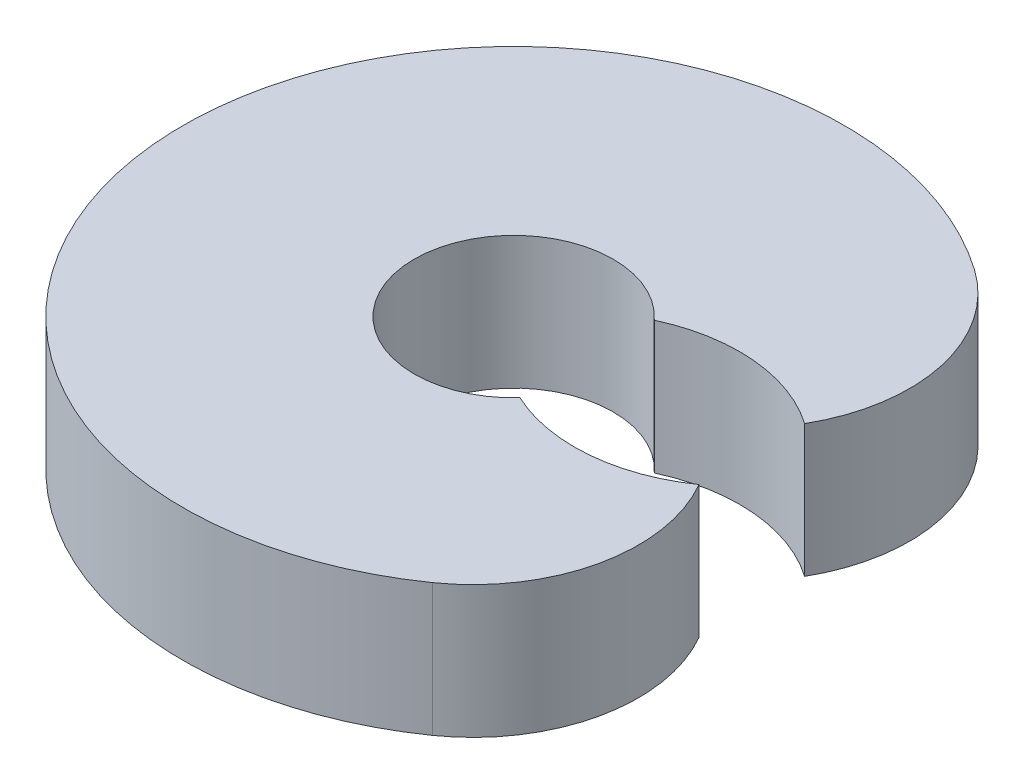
ISO-10303-21;
HEADER;
FILE_DESCRIPTION(('STEP AP214'),'2;1');
FILE_NAME('part.step','',(''),(''),'','','');
FILE_SCHEMA(('AUTOMOTIVE_DESIGN { 1 0 10303 214 1 1 1 1 }'));
ENDSEC;
DATA;
#1=APPLICATION_CONTEXT('core data for automotive mechanical design processes');
#2=APPLICATION_PROTOCOL_DEFINITION('international standard','automotive_design',2000,#1);
#3=PRODUCT_CONTEXT('',#1,'mechanical');
#4=PRODUCT('Part','Part','',(#3));
#5=PRODUCT_RELATED_PRODUCT_CATEGORY('part','',(#4));
#6=PRODUCT_DEFINITION_FORMATION('','',#4);
#7=PRODUCT_DEFINITION_CONTEXT('part definition',#1,'design');
#8=PRODUCT_DEFINITION('design','',#6,#7);
#9=PRODUCT_DEFINITION_SHAPE('','',#8);
#10=(LENGTH_UNIT() NAMED_UNIT(*) SI_UNIT(.MILLI.,.METRE.));
#11=(NAMED_UNIT(*) PLANE_ANGLE_UNIT() SI_UNIT($,.RADIAN.));
#12=(NAMED_UNIT(*) SI_UNIT($,.STERADIAN.) SOLID_ANGLE_UNIT());
#13=UNCERTAINTY_MEASURE_WITH_UNIT(LENGTH_MEASURE(1.E-05),#10,'distance_accuracy_value','');
#14=(GEOMETRIC_REPRESENTATION_CONTEXT(3) GLOBAL_UNCERTAINTY_ASSIGNED_CONTEXT((#13)) GLOBAL_UNIT_ASSIGNED_CONTEXT((#10,
#11,#12)) REPRESENTATION_CONTEXT('',''));
#15=CARTESIAN_POINT('',(0.,0.,0.));
#16=DIRECTION('',(0.,0.,1.));
#17=DIRECTION('',(1.,0.,0.));
#18=AXIS2_PLACEMENT_3D('',#15,#16,#17);
#19=CARTESIAN_POINT('',(216.627566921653,205.,125.084822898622));
#20=DIRECTION('',(0.,-1.,0.));
#21=DIRECTION('',(0.,0.,-1.));
#22=AXIS2_PLACEMENT_3D('',#19,#20,#21);
#23=CYLINDRICAL_SURFACE('',#22,250.);
#24=CARTESIAN_POINT('',(216.627566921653,5.,125.084822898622));
#25=DIRECTION('',(0.,-1.,0.));
#26=DIRECTION('',(0.,0.,-1.));
#27=AXIS2_PLACEMENT_3D('',#24,#25,#26);
#28=CIRCLE('',#27,250.);
#29=CARTESIAN_POINT('',(110.987220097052,5.,-101.498753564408));
#30=VERTEX_POINT('',#29);
#31=CARTESIAN_POINT('',(359.900460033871,5.,-79.7880110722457));
#32=VERTEX_POINT('',#31);
#33=EDGE_CURVE('E122',#30,#32,#28,.T.);
#34=ORIENTED_EDGE('',*,*,#33,.T.);
#35=DIRECTION('',(0.,-1.,0.));
#36=VECTOR('',#35,1.);
#37=CARTESIAN_POINT('',(359.900460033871,205.,-79.7880110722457));
#38=LINE('',#37,#36);
#39=CARTESIAN_POINT('',(359.900460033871,205.,-79.7880110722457));
#40=VERTEX_POINT('',#39);
#41=EDGE_CURVE('E11',#40,#32,#38,.T.);
#42=ORIENTED_EDGE('',*,*,#41,.F.);
#43=CARTESIAN_POINT('',(216.627566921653,205.,125.084822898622));
#44=DIRECTION('',(0.,-1.,0.));
#45=DIRECTION('',(0.,0.,-1.));
#46=AXIS2_PLACEMENT_3D('',#43,#44,#45);
#47=CIRCLE('',#46,250.);
#48=CARTESIAN_POINT('',(110.987220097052,205.,-101.498753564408));
#49=VERTEX_POINT('',#48);
#50=EDGE_CURVE('E132',#49,#40,#47,.T.);
#51=ORIENTED_EDGE('',*,*,#50,.F.);
#52=DIRECTION('',(0.,-1.,0.));
#53=VECTOR('',#52,1.);
#54=CARTESIAN_POINT('',(110.987220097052,205.,-101.498753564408));
#55=LINE('',#54,#53);
#56=EDGE_CURVE('E118',#49,#30,#55,.T.);
#57=ORIENTED_EDGE('',*,*,#56,.T.);
#58=EDGE_LOOP('',(#34,#42,#51,#57));
#59=FACE_BOUND('',#58,.T.);
#60=ADVANCED_FACE('F38',(#59),#23,.F.);
#61=CARTESIAN_POINT('',(143.394109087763,205.,-204.788011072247));
#62=DIRECTION('',(0.,-1.,0.));
#63=DIRECTION('',(0.,0.,-1.));
#64=AXIS2_PLACEMENT_3D('',#61,#62,#63);
#65=CYLINDRICAL_SURFACE('',#64,250.);
#66=CARTESIAN_POINT('',(143.394109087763,5.,-204.788011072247));
#67=DIRECTION('',(0.,1.,0.));
#68=DIRECTION('',(0.,0.,1.));
#69=AXIS2_PLACEMENT_3D('',#66,#67,#68);
#70=CIRCLE('',#69,250.);
#71=CARTESIAN_POINT('',(286.788218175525,5.,-409.576022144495));
#72=VERTEX_POINT('',#71);
#73=EDGE_CURVE('E125',#32,#72,#70,.T.);
#74=ORIENTED_EDGE('',*,*,#73,.T.);
#75=DIRECTION('',(0.,-1.,0.));
#76=VECTOR('',#75,1.);
#77=CARTESIAN_POINT('',(286.788218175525,205.,-409.576022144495));
#78=LINE('',#77,#76);
#79=CARTESIAN_POINT('',(286.788218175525,205.,-409.576022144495));
#80=VERTEX_POINT('',#79);
#81=EDGE_CURVE('E46',#80,#72,#78,.T.);
#82=ORIENTED_EDGE('',*,*,#81,.F.);
#83=CARTESIAN_POINT('',(143.394109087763,205.,-204.788011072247));
#84=DIRECTION('',(0.,1.,0.));
#85=DIRECTION('',(0.,0.,1.));
#86=AXIS2_PLACEMENT_3D('',#83,#84,#85);
#87=CIRCLE('',#86,250.);
#88=EDGE_CURVE('E91',#40,#80,#87,.T.);
#89=ORIENTED_EDGE('',*,*,#88,.F.);
#90=ORIENTED_EDGE('',*,*,#41,.T.);
#91=EDGE_LOOP('',(#74,#82,#89,#90));
#92=FACE_BOUND('',#91,.T.);
#93=ADVANCED_FACE('F156',(#92),#65,.T.);
#94=CARTESIAN_POINT('',(0.,205.,0.));
#95=DIRECTION('',(0.,-1.,0.));
#96=DIRECTION('',(0.,0.,-1.));
#97=AXIS2_PLACEMENT_3D('',#94,#95,#96);
#98=CYLINDRICAL_SURFACE('',#97,500.);
#99=CARTESIAN_POINT('',(0.,5.,0.));
#100=DIRECTION('',(0.,1.,0.));
#101=DIRECTION('',(0.,0.,1.));
#102=AXIS2_PLACEMENT_3D('',#99,#100,#101);
#103=CIRCLE('',#102,500.);
#104=CARTESIAN_POINT('',(286.788218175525,5.,409.576022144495));
#105=VERTEX_POINT('',#104);
#106=EDGE_CURVE('E127',#72,#105,#103,.T.);
#107=ORIENTED_EDGE('',*,*,#106,.T.);
#108=DIRECTION('',(0.,-1.,0.));
#109=VECTOR('',#108,1.);
#110=CARTESIAN_POINT('',(286.788218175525,205.,409.576022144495));
#111=LINE('',#110,#109);
#112=CARTESIAN_POINT('',(286.788218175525,205.,409.576022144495));
#113=VERTEX_POINT('',#112);
#114=EDGE_CURVE('E113',#113,#105,#111,.T.);
#115=ORIENTED_EDGE('',*,*,#114,.F.);
#116=CARTESIAN_POINT('',(0.,205.,0.));
#117=DIRECTION('',(0.,1.,0.));
#118=DIRECTION('',(0.,0.,1.));
#119=AXIS2_PLACEMENT_3D('',#116,#117,#118);
#120=CIRCLE('',#119,500.);
#121=EDGE_CURVE('E104',#80,#113,#120,.T.);
#122=ORIENTED_EDGE('',*,*,#121,.F.);
#123=ORIENTED_EDGE('',*,*,#81,.T.);
#124=EDGE_LOOP('',(#107,#115,#122,#123));
#125=FACE_BOUND('',#124,.T.);
#126=ADVANCED_FACE('F138',(#125),#98,.T.);
#127=CARTESIAN_POINT('',(143.394109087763,205.,204.788011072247));
#128=DIRECTION('',(0.,-1.,0.));
#129=DIRECTION('',(0.,0.,-1.));
#130=AXIS2_PLACEMENT_3D('',#127,#128,#129);
#131=CYLINDRICAL_SURFACE('',#130,250.);
#132=CARTESIAN_POINT('',(143.394109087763,5.,204.788011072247));
#133=DIRECTION('',(0.,1.,0.));
#134=DIRECTION('',(0.,0.,1.));
#135=AXIS2_PLACEMENT_3D('',#132,#133,#134);
#136=CIRCLE('',#135,250.);
#137=CARTESIAN_POINT('',(359.900460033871,5.,79.7880110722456));
#138=VERTEX_POINT('',#137);
#139=EDGE_CURVE('E112',#105,#138,#136,.T.);
#140=ORIENTED_EDGE('',*,*,#139,.T.);
#141=DIRECTION('',(0.,-1.,0.));
#142=VECTOR('',#141,1.);
#143=CARTESIAN_POINT('',(359.900460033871,205.,79.7880110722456));
#144=LINE('',#143,#142);
#145=CARTESIAN_POINT('',(359.900460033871,205.,79.7880110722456));
#146=VERTEX_POINT('',#145);
#147=EDGE_CURVE('E109',#146,#138,#144,.T.);
#148=ORIENTED_EDGE('',*,*,#147,.F.);
#149=CARTESIAN_POINT('',(143.394109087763,205.,204.788011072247));
#150=DIRECTION('',(0.,1.,0.));
#151=DIRECTION('',(0.,0.,1.));
#152=AXIS2_PLACEMENT_3D('',#149,#150,#151);
#153=CIRCLE('',#152,250.);
#154=EDGE_CURVE('E98',#113,#146,#153,.T.);
#155=ORIENTED_EDGE('',*,*,#154,.F.);
#156=ORIENTED_EDGE('',*,*,#114,.T.);
#157=EDGE_LOOP('',(#140,#148,#155,#156));
#158=FACE_BOUND('',#157,.T.);
#159=ADVANCED_FACE('F110',(#158),#131,.T.);
#160=CARTESIAN_POINT('',(216.627566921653,205.,-125.084822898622));
#161=DIRECTION('',(0.,-1.,0.));
#162=DIRECTION('',(0.,0.,-1.));
#163=AXIS2_PLACEMENT_3D('',#160,#161,#162);
#164=CYLINDRICAL_SURFACE('',#163,250.);
#165=CARTESIAN_POINT('',(216.627566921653,5.,-125.084822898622));
#166=DIRECTION('',(0.,-1.,0.));
#167=DIRECTION('',(0.,0.,1.));
#168=AXIS2_PLACEMENT_3D('',#165,#166,#167);
#169=CIRCLE('',#168,250.);
#170=CARTESIAN_POINT('',(110.987220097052,5.,101.498753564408));
#171=VERTEX_POINT('',#170);
#172=EDGE_CURVE('E77',#138,#171,#169,.T.);
#173=ORIENTED_EDGE('',*,*,#172,.T.);
#174=DIRECTION('',(0.,-1.,0.));
#175=VECTOR('',#174,1.);
#176=CARTESIAN_POINT('',(110.987220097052,205.,101.498753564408));
#177=LINE('',#176,#175);
#178=CARTESIAN_POINT('',(110.987220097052,205.,101.498753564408));
#179=VERTEX_POINT('',#178);
#180=EDGE_CURVE('E114',#179,#171,#177,.T.);
#181=ORIENTED_EDGE('',*,*,#180,.F.);
#182=CARTESIAN_POINT('',(216.627566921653,205.,-125.084822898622));
#183=DIRECTION('',(0.,-1.,0.));
#184=DIRECTION('',(0.,0.,1.));
#185=AXIS2_PLACEMENT_3D('',#182,#183,#184);
#186=CIRCLE('',#185,250.);
#187=EDGE_CURVE('E102',#146,#179,#186,.T.);
#188=ORIENTED_EDGE('',*,*,#187,.F.);
#189=ORIENTED_EDGE('',*,*,#147,.T.);
#190=EDGE_LOOP('',(#173,#181,#188,#189));
#191=FACE_BOUND('',#190,.T.);
#192=ADVANCED_FACE('F116',(#191),#164,.F.);
#193=CARTESIAN_POINT('',(0.,205.,0.));
#194=DIRECTION('',(0.,-1.,0.));
#195=DIRECTION('',(0.,0.,-1.));
#196=AXIS2_PLACEMENT_3D('',#193,#194,#195);
#197=CYLINDRICAL_SURFACE('',#196,150.4);
#198=CARTESIAN_POINT('',(0.,5.,0.));
#199=DIRECTION('',(0.,-1.,0.));
#200=DIRECTION('',(0.,0.,1.));
#201=AXIS2_PLACEMENT_3D('',#198,#199,#200);
#202=CIRCLE('',#201,150.4);
#203=EDGE_CURVE('E83',#171,#30,#202,.T.);
#204=ORIENTED_EDGE('',*,*,#203,.T.);
#205=ORIENTED_EDGE('',*,*,#56,.F.);
#206=CARTESIAN_POINT('',(0.,205.,0.));
#207=DIRECTION('',(0.,-1.,0.));
#208=DIRECTION('',(0.,0.,1.));
#209=AXIS2_PLACEMENT_3D('',#206,#207,#208);
#210=CIRCLE('',#209,150.4);
#211=EDGE_CURVE('E54',#179,#49,#210,.T.);
#212=ORIENTED_EDGE('',*,*,#211,.F.);
#213=ORIENTED_EDGE('',*,*,#180,.T.);
#214=EDGE_LOOP('',(#204,#205,#212,#213));
#215=FACE_BOUND('',#214,.T.);
#216=ADVANCED_FACE('F145',(#215),#197,.F.);
#217=CARTESIAN_POINT('',(180.010838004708,205.,-39.8515940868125));
#218=DIRECTION('',(0.,-1.,0.));
#219=DIRECTION('',(0.,0.,-1.));
#220=AXIS2_PLACEMENT_3D('',#217,#218,#219);
#221=PLANE('',#220);
#222=ORIENTED_EDGE('',*,*,#50,.T.);
#223=ORIENTED_EDGE('',*,*,#88,.T.);
#224=ORIENTED_EDGE('',*,*,#121,.T.);
#225=ORIENTED_EDGE('',*,*,#154,.T.);
#226=ORIENTED_EDGE('',*,*,#187,.T.);
#227=ORIENTED_EDGE('',*,*,#211,.T.);
#228=EDGE_LOOP('',(#222,#223,#224,#225,#226,#227));
#229=FACE_BOUND('',#228,.T.);
#230=ADVANCED_FACE('F100',(#229),#221,.F.);
#231=CARTESIAN_POINT('',(180.010838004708,5.,-39.8515940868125));
#232=DIRECTION('',(0.,-1.,0.));
#233=DIRECTION('',(0.,0.,-1.));
#234=AXIS2_PLACEMENT_3D('',#231,#232,#233);
#235=PLANE('',#234);
#236=ORIENTED_EDGE('',*,*,#33,.F.);
#237=ORIENTED_EDGE('',*,*,#203,.F.);
#238=ORIENTED_EDGE('',*,*,#172,.F.);
#239=ORIENTED_EDGE('',*,*,#139,.F.);
#240=ORIENTED_EDGE('',*,*,#106,.F.);
#241=ORIENTED_EDGE('',*,*,#73,.F.);
#242=EDGE_LOOP('',(#236,#237,#238,#239,#240,#241));
#243=FACE_BOUND('',#242,.T.);
#244=ADVANCED_FACE('F141',(#243),#235,.T.);
#245=CLOSED_SHELL('',(#60,#93,#126,#159,#192,#216,#230,#244));
#246=MANIFOLD_SOLID_BREP('B2',#245);
#247=ADVANCED_BREP_SHAPE_REPRESENTATION('',(#18,#246),#14);
#248=SHAPE_DEFINITION_REPRESENTATION(#9,#247);
ENDSEC;
END-ISO-10303-21;
